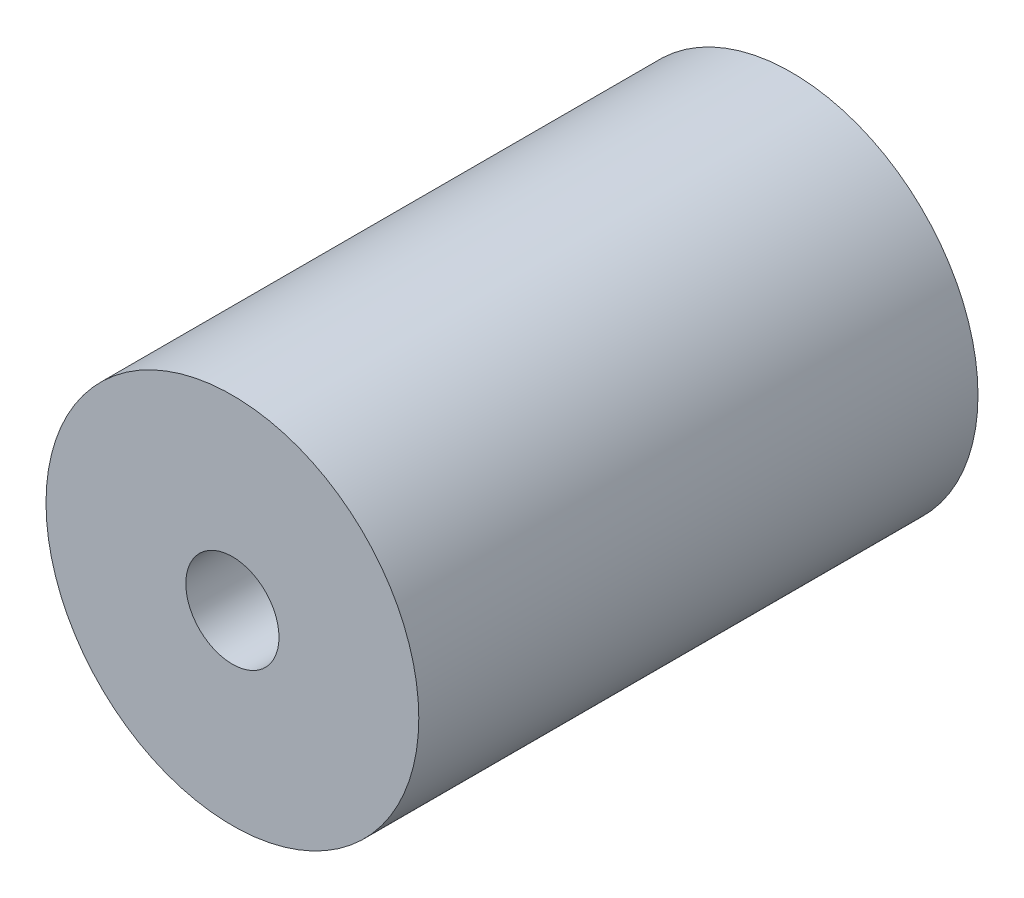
from build123d import *

# Parameters (mm, degrees)
ESQUISSE1_R      = 200
ESQUISSE1_R_2    = 50
EXTRUSION1_DEPTH = 300


with BuildPart() as part:
    # Esquisse1 → Extrusion1 (new, symmetric)
    with BuildSketch(Plane.XY):
        Circle(ESQUISSE1_R)
        Circle(ESQUISSE1_R_2, mode=Mode.SUBTRACT)
    extrude(amount=EXTRUSION1_DEPTH, both=True)


solid = part.part
